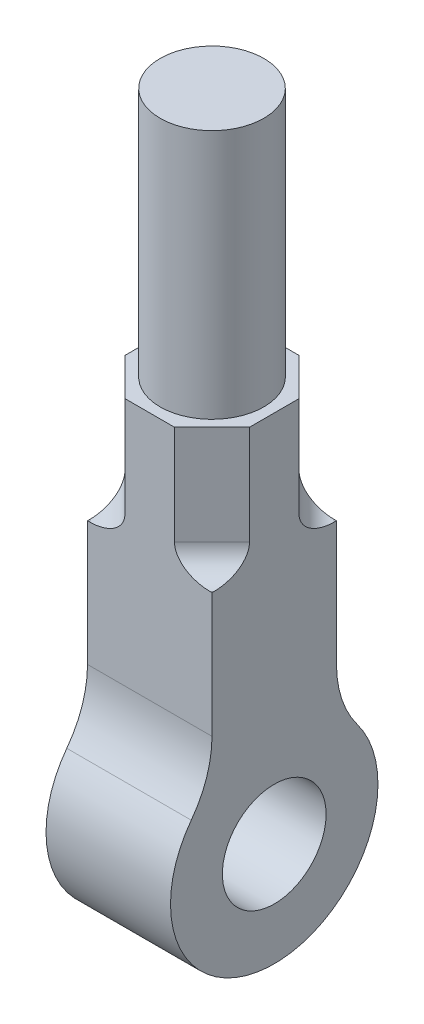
from build123d import *

# Parameters (mm, degrees)
SKETCH1_R           = 25
BOSS_EXTRUDE1_DEPTH = 60
CUT_EXTRUDE1_DEPTH  = 60
SKETCH2_4_R         = 25
BOSS_EXTRUDE2_DEPTH = 120.5
FILLET1_R           = 12


with BuildPart() as part:
    # Sketch1 → Boss-Extrude1 (new body)
    with BuildSketch(Plane.YZ):
        with BuildLine():
            Line((60, 30), (180, 30))
            Line((180, 30), (180, -30))
            Line((180, -30), (60, -30))
            ThreePointArc((60, -30), (44.188611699, -32.565835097), (30, -40))
            ThreePointArc((30, -40), (-50, 0), (30, 40))
            ThreePointArc((30, 40), (44.188611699, 32.565835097), (60, 30))
        make_face()
        with Locations(Location((0, 0, 0), (0, 0, 270))):
            Circle(SKETCH1_R, mode=Mode.SUBTRACT)
    extrude(amount=BOSS_EXTRUDE1_DEPTH)

    # Sketch2 → Cut-Extrude1 (cut)
    with BuildSketch(Plane(origin=(0, 180, 0), x_dir=(-1, 0, 0), z_dir=(0, 1, 0))):
        Polygon((-60, 11.94), (-41.94, 30), (-60, 30), align=None)
        Polygon((0, 30), (-18.06, 30), (0, 11.94), align=None)
        Polygon((0, -30), (0, -11.94), (-18.06, -30), align=None)
        Polygon((-41.94, -30), (-60, -11.94), (-60, -30), align=None)
    extrude(amount=-CUT_EXTRUDE1_DEPTH, mode=Mode.SUBTRACT)

    # Sketch2_4 → Boss-Extrude2 (add)
    with BuildSketch(Plane(origin=(0, 180, 0), x_dir=(-1, 0, 0), z_dir=(0, 1, 0))):
        with Locations(Location((-30, 0, 0), (0, 0, 90))):
            Circle(SKETCH2_4_R)
    extrude(amount=BOSS_EXTRUDE2_DEPTH)

    # Fillet1
    fillet1_edges = [part.edges().sort_by_distance(p)[0] for p in [
        (50.97, 120, -20.97),
        (9.03, 120, -20.97),
        (9.03, 120, 20.97),
        (50.97, 120, 20.97),
    ]]
    fillet(fillet1_edges, radius=FILLET1_R)


solid = part.part
